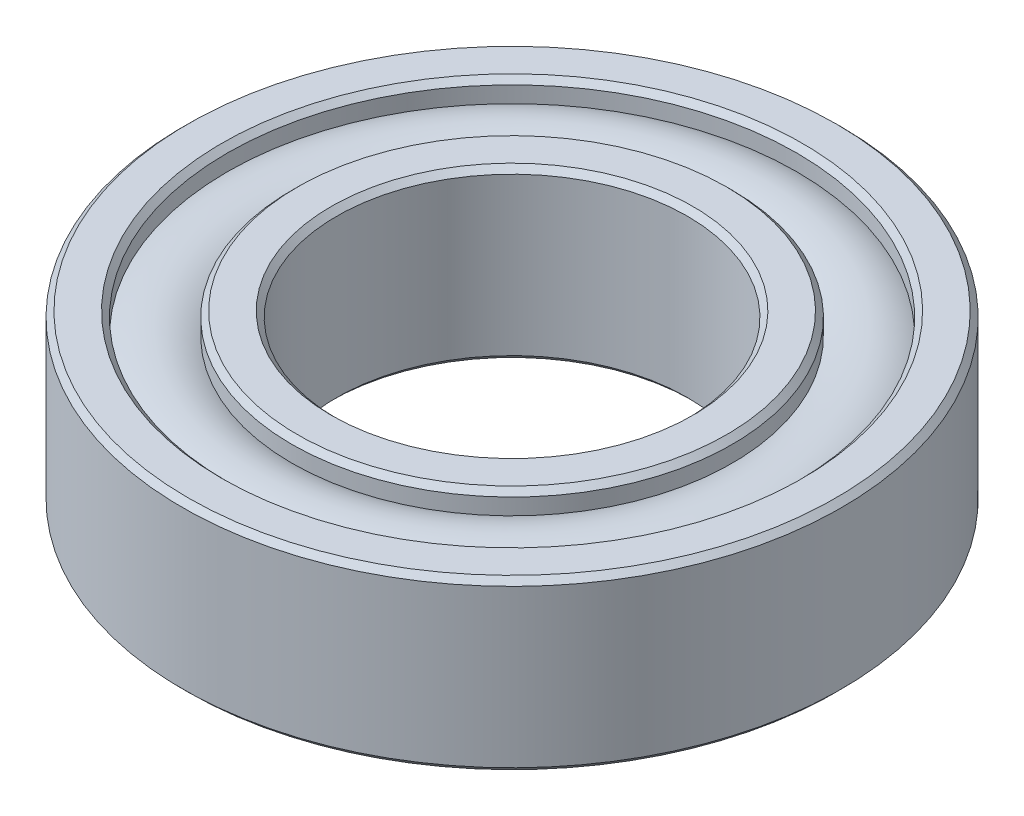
from build123d import *

# Parameters (mm, degrees)
CHANFREIN1_SIZE = 0.4


with BuildPart() as part:
    # Esquisse1 → R_volution1 (revolve)
    with BuildSketch(Plane.XY, mode=Mode.PRIVATE) as r_volution1_sk:
        with BuildLine():
            Line((12.5, 0), (15.7, 0))
            Line((15.7, 0), (15.7, 1.560405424))
            ThreePointArc((15.7, 1.560405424), (18, 1), (20.3, 1.560405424))
            Line((20.3, 1.560405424), (20.3, 0))
            Line((20.3, 0), (23.5, 0))
            Line((23.5, 0), (23.5, 12))
            Line((23.5, 12), (20.3, 12))
            Line((20.3, 12), (20.3, 10.439594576))
            ThreePointArc((20.3, 10.439594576), (18, 11), (15.7, 10.439594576))
            Line((15.7, 10.439594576), (15.7, 12))
            Line((15.7, 12), (12.5, 12))
            Line((12.5, 12), (12.5, 0))
        make_face()
    revolve(r_volution1_sk.sketch.rotate(Axis((0, 0, 0), (0, 1, 0)), 90), axis=Axis((0, 0, 0), (0, 1, 0)))

    # Chanfrein1
    chanfrein1_edges = [part.edges().sort_by_distance(p)[0] for p in [
        (0, 0, 20.3),
        (0, 0, 15.7),
        (0, 0, 12.5),
        (0, 12, 12.5),
        (0, 12, 15.7),
        (0, 12, 20.3),
        (0, 12, 23.5),
        (0, 0, 23.5),
    ]]
    chamfer(chanfrein1_edges, length=CHANFREIN1_SIZE)


solid = part.part
